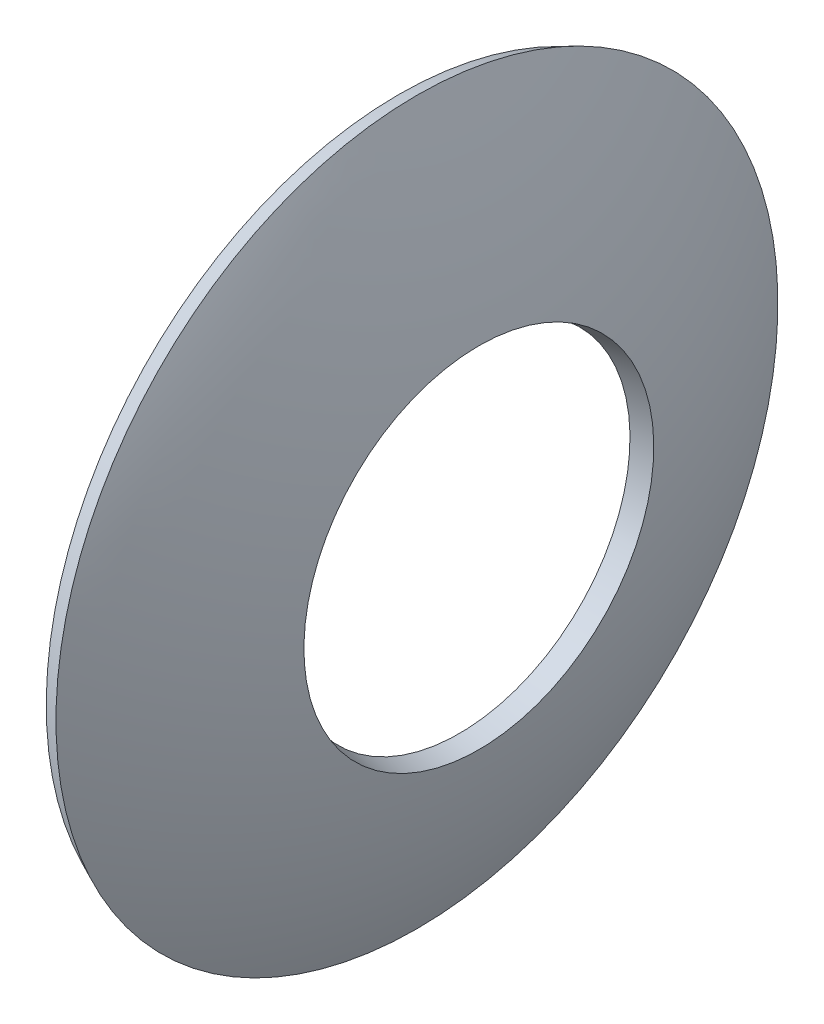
ISO-10303-21;
HEADER;
FILE_DESCRIPTION(('STEP AP214'),'2;1');
FILE_NAME('part.step','',(''),(''),'','','');
FILE_SCHEMA(('AUTOMOTIVE_DESIGN { 1 0 10303 214 1 1 1 1 }'));
ENDSEC;
DATA;
#1=APPLICATION_CONTEXT('core data for automotive mechanical design processes');
#2=APPLICATION_PROTOCOL_DEFINITION('international standard','automotive_design',2000,#1);
#3=PRODUCT_CONTEXT('',#1,'mechanical');
#4=PRODUCT('Part','Part','',(#3));
#5=PRODUCT_RELATED_PRODUCT_CATEGORY('part','',(#4));
#6=PRODUCT_DEFINITION_FORMATION('','',#4);
#7=PRODUCT_DEFINITION_CONTEXT('part definition',#1,'design');
#8=PRODUCT_DEFINITION('design','',#6,#7);
#9=PRODUCT_DEFINITION_SHAPE('','',#8);
#10=(LENGTH_UNIT() NAMED_UNIT(*) SI_UNIT(.MILLI.,.METRE.));
#11=(NAMED_UNIT(*) PLANE_ANGLE_UNIT() SI_UNIT($,.RADIAN.));
#12=(NAMED_UNIT(*) SI_UNIT($,.STERADIAN.) SOLID_ANGLE_UNIT());
#13=UNCERTAINTY_MEASURE_WITH_UNIT(LENGTH_MEASURE(1.E-05),#10,'distance_accuracy_value','');
#14=(GEOMETRIC_REPRESENTATION_CONTEXT(3) GLOBAL_UNCERTAINTY_ASSIGNED_CONTEXT((#13)) GLOBAL_UNIT_ASSIGNED_CONTEXT((#10,
#11,#12)) REPRESENTATION_CONTEXT('',''));
#15=CARTESIAN_POINT('',(0.,0.,0.));
#16=DIRECTION('',(0.,0.,1.));
#17=DIRECTION('',(1.,0.,0.));
#18=AXIS2_PLACEMENT_3D('',#15,#16,#17);
#19=CARTESIAN_POINT('',(0.,0.,0.));
#20=DIRECTION('',(-1.,0.,0.));
#21=DIRECTION('',(0.,1.,0.));
#22=AXIS2_PLACEMENT_3D('',#19,#20,#21);
#23=SPHERICAL_SURFACE('',#22,41.5);
#24=CARTESIAN_POINT('',(40.6201920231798,0.,0.));
#25=DIRECTION('',(-1.,0.,0.));
#26=DIRECTION('',(0.,0.,1.));
#27=AXIS2_PLACEMENT_3D('',#24,#25,#26);
#28=CIRCLE('',#27,8.5);
#29=CARTESIAN_POINT('',(40.6201920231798,8.50000000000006,0.));
#30=VERTEX_POINT('',#29);
#31=EDGE_CURVE('E58',#30,#30,#28,.T.);
#32=CARTESIAN_POINT('',(37.6117731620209,0.,0.));
#33=DIRECTION('',(-1.,0.,0.));
#34=DIRECTION('',(0.,0.,1.));
#35=AXIS2_PLACEMENT_3D('',#32,#33,#34);
#36=CIRCLE('',#35,17.5386578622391);
#37=CARTESIAN_POINT('',(37.6117731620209,17.5386578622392,0.));
#38=VERTEX_POINT('',#37);
#39=EDGE_CURVE('E12',#38,#38,#36,.T.);
#40=CARTESIAN_POINT('',(40.6201920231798,8.50000000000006,0.));
#41=CARTESIAN_POINT('',(40.5998227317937,8.59734174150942,0.));
#42=CARTESIAN_POINT('',(40.5791035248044,8.69461026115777,0.));
#43=CARTESIAN_POINT('',(40.5369663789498,8.88899583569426,0.));
#44=CARTESIAN_POINT('',(40.5155484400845,8.9861128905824,0.));
#45=CARTESIAN_POINT('',(40.4720149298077,9.1801905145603,0.));
#46=CARTESIAN_POINT('',(40.4498993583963,9.27715108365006,0.));
#47=CARTESIAN_POINT('',(40.4049717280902,9.47091072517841,0.));
#48=CARTESIAN_POINT('',(40.3821596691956,9.56770979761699,0.));
#49=CARTESIAN_POINT('',(40.3358402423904,9.76114144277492,0.));
#50=CARTESIAN_POINT('',(40.3123328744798,9.85777401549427,0.));
#51=CARTESIAN_POINT('',(40.264624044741,10.0508676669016,0.));
#52=CARTESIAN_POINT('',(40.2404225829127,10.1473287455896,0.));
#53=CARTESIAN_POINT('',(40.1913268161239,10.3400744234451,0.));
#54=CARTESIAN_POINT('',(40.1664325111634,10.4363590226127,0.));
#55=CARTESIAN_POINT('',(40.1159523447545,10.6287467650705,0.));
#56=CARTESIAN_POINT('',(40.090366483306,10.7248499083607,0.));
#57=CARTESIAN_POINT('',(40.0385045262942,10.916869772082,0.));
#58=CARTESIAN_POINT('',(40.0122284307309,11.0127864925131,0.));
#59=CARTESIAN_POINT('',(39.9589873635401,11.2044285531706,0.));
#60=CARTESIAN_POINT('',(39.9320223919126,11.3001538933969,0.));
#61=CARTESIAN_POINT('',(39.877404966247,11.49140824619,0.));
#62=CARTESIAN_POINT('',(39.8497525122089,11.5869372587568,0.));
#63=CARTESIAN_POINT('',(39.7937615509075,11.7777940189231,0.));
#64=CARTESIAN_POINT('',(39.7654230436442,11.8731217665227,0.));
#65=CARTESIAN_POINT('',(39.7080614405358,12.063571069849,0.));
#66=CARTESIAN_POINT('',(39.6790383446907,12.1586926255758,0.));
#67=CARTESIAN_POINT('',(39.6203090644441,12.3487246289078,0.));
#68=CARTESIAN_POINT('',(39.5906028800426,12.443635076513,0.));
#69=CARTESIAN_POINT('',(39.5305089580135,12.633239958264,0.));
#70=CARTESIAN_POINT('',(39.5001212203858,12.7279343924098,0.));
#71=CARTESIAN_POINT('',(39.4386657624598,12.9171023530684,0.));
#72=CARTESIAN_POINT('',(39.4075980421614,13.0115758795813,0.));
#73=CARTESIAN_POINT('',(39.3447842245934,13.200297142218,0.));
#74=CARTESIAN_POINT('',(39.3130381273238,13.2945448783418,0.));
#75=CARTESIAN_POINT('',(39.2488691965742,13.4828096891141,0.));
#76=CARTESIAN_POINT('',(39.2164463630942,13.5768267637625,0.));
#77=CARTESIAN_POINT('',(39.1509256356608,13.7646253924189,0.));
#78=CARTESIAN_POINT('',(39.1178277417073,13.8584069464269,0.));
#79=CARTESIAN_POINT('',(39.0509586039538,14.0457296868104,0.));
#80=CARTESIAN_POINT('',(39.0171873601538,14.1392708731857,0.));
#81=CARTESIAN_POINT('',(38.9489732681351,14.3261080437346,0.));
#82=CARTESIAN_POINT('',(38.9145304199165,14.4194040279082,0.));
#83=CARTESIAN_POINT('',(38.8449748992,14.6057459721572,0.));
#84=CARTESIAN_POINT('',(38.8098622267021,14.6987919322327,0.));
#85=CARTESIAN_POINT('',(38.7389688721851,14.8846290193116,0.));
#86=CARTESIAN_POINT('',(38.7031881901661,14.9774201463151,0.));
#87=CARTESIAN_POINT('',(38.6309606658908,15.1627427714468,0.));
#88=CARTESIAN_POINT('',(38.5945138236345,15.2552742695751,0.));
#89=CARTESIAN_POINT('',(38.5209558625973,15.4400728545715,0.));
#90=CARTESIAN_POINT('',(38.4838447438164,15.5323399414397,0.));
#91=CARTESIAN_POINT('',(38.4089601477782,15.7166049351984,0.));
#92=CARTESIAN_POINT('',(38.371186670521,15.8086028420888,0.));
#93=CARTESIAN_POINT('',(38.2949793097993,15.992324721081,0.));
#94=CARTESIAN_POINT('',(38.2565454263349,16.0840486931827,0.));
#95=CARTESIAN_POINT('',(38.1790192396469,16.2672179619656,0.));
#96=CARTESIAN_POINT('',(38.1399269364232,16.3586632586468,0.));
#97=CARTESIAN_POINT('',(38.0610859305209,16.5412704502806,0.));
#98=CARTESIAN_POINT('',(38.0213372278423,16.6324323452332,0.));
#99=CARTESIAN_POINT('',(37.9411854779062,16.814468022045,0.));
#100=CARTESIAN_POINT('',(37.9007824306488,16.905341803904,0.));
#101=CARTESIAN_POINT('',(37.8193240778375,17.0867965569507,0.));
#102=CARTESIAN_POINT('',(37.7782687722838,17.1773775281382,0.));
#103=CARTESIAN_POINT('',(37.6955080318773,17.358241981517,0.));
#104=CARTESIAN_POINT('',(37.6538025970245,17.4485254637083,0.));
#105=CARTESIAN_POINT('',(37.6117731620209,17.5386578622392,0.));
#106=B_SPLINE_CURVE_WITH_KNOTS('',3,(#40,#41,#42,#43,#44,#45,#46,#47,#48,#49,#50,#51,#52,#53,
#54,#55,#56,#57,#58,#59,#60,#61,#62,#63,#64,#65,#66,#67,#68,#69,#70,#71,#72,#73,#74,#75,#76,#77,
#78,#79,#80,#81,#82,#83,#84,#85,#86,#87,#88,#89,#90,#91,#92,#93,#94,#95,#96,#97,#98,#99,#100,
#101,#102,#103,#104,#105),.UNSPECIFIED.,.F.,.F.,(4,2,2,2,2,2,2,2,2,2,2,2,2,2,2,2,2,2,2,2,2,2,2,
2,2,2,2,2,2,2,2,2,4),(0.,0.298349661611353,0.596699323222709,0.895048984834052,1.19339864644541,
1.49174830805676,1.79009796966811,2.08844763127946,2.38679729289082,2.68514695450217,
2.98349661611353,3.28184627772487,3.58019593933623,3.87854560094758,4.17689526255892,
4.47524492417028,4.77359458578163,5.07194424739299,5.37029390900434,5.66864357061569,
5.96699323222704,6.2653428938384,6.56369255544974,6.8620422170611,7.16039187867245,
7.4587415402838,7.75709120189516,8.0554408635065,8.35379052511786,8.65214018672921,
8.95048984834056,9.24883950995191,9.54718917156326),.UNSPECIFIED.);
#107=EDGE_CURVE('BSEAM44',#30,#38,#106,.T.);
#108=ORIENTED_EDGE('',*,*,#31,.F.);
#109=ORIENTED_EDGE('',*,*,#39,.T.);
#110=ORIENTED_EDGE('',*,*,#107,.T.);
#111=ORIENTED_EDGE('',*,*,#107,.F.);
#112=EDGE_LOOP('',(#108,#110,#109,#111));
#113=FACE_BOUND('',#112,.T.);
#114=ADVANCED_FACE('F44',(#113),#23,.F.);
#115=CARTESIAN_POINT('',(37.6117731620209,0.,0.));
#116=DIRECTION('',(1.,0.,0.));
#117=DIRECTION('',(0.,0.,-1.));
#118=AXIS2_PLACEMENT_3D('',#115,#116,#117);
#119=CONICAL_SURFACE('',#118,17.5386578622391,0.436332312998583);
#120=CARTESIAN_POINT('',(38.5180809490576,0.,0.));
#121=DIRECTION('',(-1.,0.,0.));
#122=DIRECTION('',(0.,0.,1.));
#123=AXIS2_PLACEMENT_3D('',#120,#121,#122);
#124=CIRCLE('',#123,17.9612761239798);
#125=CARTESIAN_POINT('',(38.5180809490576,17.9612761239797,0.));
#126=VERTEX_POINT('',#125);
#127=EDGE_CURVE('E50',#126,#126,#124,.T.);
#128=ORIENTED_EDGE('',*,*,#127,.T.);
#129=EDGE_LOOP('',(#128));
#130=FACE_BOUND('',#129,.T.);
#131=ORIENTED_EDGE('',*,*,#39,.F.);
#132=EDGE_LOOP('',(#131));
#133=FACE_BOUND('',#132,.T.);
#134=ADVANCED_FACE('F68',(#130,#133),#119,.T.);
#135=CARTESIAN_POINT('',(0.,0.,0.));
#136=DIRECTION('',(-1.,0.,0.));
#137=DIRECTION('',(0.,1.,0.));
#138=AXIS2_PLACEMENT_3D('',#135,#136,#137);
#139=SPHERICAL_SURFACE('',#138,42.5);
#140=CARTESIAN_POINT('',(41.5989918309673,0.,0.));
#141=DIRECTION('',(-1.,0.,0.));
#142=DIRECTION('',(0.,0.,1.));
#143=AXIS2_PLACEMENT_3D('',#140,#141,#142);
#144=CIRCLE('',#143,8.70481927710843);
#145=CARTESIAN_POINT('',(41.5989918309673,8.70481927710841,0.));
#146=VERTEX_POINT('',#145);
#147=EDGE_CURVE('E54',#146,#146,#144,.T.);
#148=CARTESIAN_POINT('',(41.5989918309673,8.70481927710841,0.));
#149=CARTESIAN_POINT('',(41.5781317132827,8.80450660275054,0.));
#150=CARTESIAN_POINT('',(41.5569132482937,8.90411894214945,0.));
#151=CARTESIAN_POINT('',(41.513760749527,9.1031885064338,0.));
#152=CARTESIAN_POINT('',(41.4918267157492,9.20264573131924,0.));
#153=CARTESIAN_POINT('',(41.4472442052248,9.40139992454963,0.));
#154=CARTESIAN_POINT('',(41.4245957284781,9.50069689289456,0.));
#155=CARTESIAN_POINT('',(41.3785855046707,9.69912544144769,0.));
#156=CARTESIAN_POINT('',(41.35522375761,9.79825702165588,0.));
#157=CARTESIAN_POINT('',(41.3077882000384,9.99634967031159,0.));
#158=CARTESIAN_POINT('',(41.2837143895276,10.0953107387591,0.));
#159=CARTESIAN_POINT('',(41.2348559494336,10.2930572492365,0.));
#160=CARTESIAN_POINT('',(41.2100713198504,10.3918426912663,0.));
#161=CARTESIAN_POINT('',(41.1597925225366,10.5892328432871,0.));
#162=CARTESIAN_POINT('',(41.1342983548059,10.687837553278,0.));
#163=CARTESIAN_POINT('',(41.082601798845,10.8848611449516,0.));
#164=CARTESIAN_POINT('',(41.0563994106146,10.9832800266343,0.));
#165=CARTESIAN_POINT('',(41.0032877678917,11.1799268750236,0.));
#166=CARTESIAN_POINT('',(40.9763785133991,11.2781548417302,0.));
#167=CARTESIAN_POINT('',(40.9218545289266,11.4744147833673,0.));
#168=CARTESIAN_POINT('',(40.8942397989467,11.5724467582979,0.));
#169=CARTESIAN_POINT('',(40.8383062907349,11.7683096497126,0.));
#170=CARTESIAN_POINT('',(40.8099875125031,11.8661405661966,0.));
#171=CARTESIAN_POINT('',(40.7526473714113,12.0615962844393,0.));
#172=CARTESIAN_POINT('',(40.7236260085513,12.1592210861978,0.));
#173=CARTESIAN_POINT('',(40.6648821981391,12.3542595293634,0.));
#174=CARTESIAN_POINT('',(40.6351597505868,12.4516731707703,0.));
#175=CARTESIAN_POINT('',(40.5750153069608,12.6462842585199,0.));
#176=CARTESIAN_POINT('',(40.544593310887,12.7434817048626,0.));
#177=CARTESIAN_POINT('',(40.483051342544,12.937655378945,0.));
#178=CARTESIAN_POINT('',(40.4519313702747,13.0346316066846,0.));
#179=CARTESIAN_POINT('',(40.3889950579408,13.2283578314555,0.));
#180=CARTESIAN_POINT('',(40.3571787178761,13.3251078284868,0.));
#181=CARTESIAN_POINT('',(40.2928513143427,13.5183765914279,0.));
#182=CARTESIAN_POINT('',(40.2603402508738,13.6148953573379,0.));
#183=CARTESIAN_POINT('',(40.1946250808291,13.8076966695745,0.));
#184=CARTESIAN_POINT('',(40.1614209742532,13.9039792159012,0.));
#185=CARTESIAN_POINT('',(40.0943214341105,14.096303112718,0.));
#186=CARTESIAN_POINT('',(40.0604260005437,14.1923444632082,0.));
#187=CARTESIAN_POINT('',(39.991945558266,14.3841810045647,0.));
#188=CARTESIAN_POINT('',(39.9573605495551,14.4799761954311,0.));
#189=CARTESIAN_POINT('',(39.8875027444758,14.6713154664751,0.));
#190=CARTESIAN_POINT('',(39.8522299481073,14.7668595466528,0.));
#191=CARTESIAN_POINT('',(39.780998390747,14.9576916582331,0.));
#192=CARTESIAN_POINT('',(39.7450396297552,15.0529796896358,0.));
#193=CARTESIAN_POINT('',(39.6724380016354,15.243294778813,0.));
#194=CARTESIAN_POINT('',(39.6357951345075,15.3383218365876,0.));
#195=CARTESIAN_POINT('',(39.5618271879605,15.5281100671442,0.));
#196=CARTESIAN_POINT('',(39.5245021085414,15.6228712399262,0.));
#197=CARTESIAN_POINT('',(39.4491716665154,15.8121228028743,0.));
#198=CARTESIAN_POINT('',(39.4111663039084,15.9066131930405,0.));
#199=CARTESIAN_POINT('',(39.3344772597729,16.0953183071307,0.));
#200=CARTESIAN_POINT('',(39.2957935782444,16.1895330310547,0.));
#201=CARTESIAN_POINT('',(39.2177498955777,16.3776819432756,0.));
#202=CARTESIAN_POINT('',(39.1783898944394,16.4716161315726,0.));
#203=CARTESIAN_POINT('',(39.0989956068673,16.6591991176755,0.));
#204=CARTESIAN_POINT('',(39.0589613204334,16.7528479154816,0.));
#205=CARTESIAN_POINT('',(38.9782205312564,16.9398552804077,0.));
#206=CARTESIAN_POINT('',(38.9375140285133,17.0332138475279,0.));
#207=CARTESIAN_POINT('',(38.8554309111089,17.2196359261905,0.));
#208=CARTESIAN_POINT('',(38.8140542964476,17.3126994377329,0.));
#209=CARTESIAN_POINT('',(38.7306330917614,17.4985265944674,0.));
#210=CARTESIAN_POINT('',(38.6885885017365,17.5912902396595,0.));
#211=CARTESIAN_POINT('',(38.6038335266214,17.7765128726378,0.));
#212=CARTESIAN_POINT('',(38.5611231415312,17.868971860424,0.));
#213=CARTESIAN_POINT('',(38.5180809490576,17.9612761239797,0.));
#214=B_SPLINE_CURVE_WITH_KNOTS('',3,(#148,#149,#150,#151,#152,#153,#154,#155,#156,#157,#158,
#159,#160,#161,#162,#163,#164,#165,#166,#167,#168,#169,#170,#171,#172,#173,#174,#175,#176,#177,
#178,#179,#180,#181,#182,#183,#184,#185,#186,#187,#188,#189,#190,#191,#192,#193,#194,#195,#196,
#197,#198,#199,#200,#201,#202,#203,#204,#205,#206,#207,#208,#209,#210,#211,#212,#213),
.UNSPECIFIED.,.F.,.F.,(4,2,2,2,2,2,2,2,2,2,2,2,2,2,2,2,2,2,2,2,2,2,2,2,2,2,2,2,2,2,2,2,4),(0.,
0.305538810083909,0.611077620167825,0.916616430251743,1.22215524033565,1.52769405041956,
1.83323286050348,2.13877167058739,2.4443104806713,2.74984929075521,3.05538810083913,
3.36092691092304,3.66646572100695,3.97200453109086,4.27754334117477,4.58308215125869,
4.8886209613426,5.19415977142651,5.49969858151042,5.80523739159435,6.11077620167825,
6.41631501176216,6.72185382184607,7.02739263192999,7.3329314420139,7.63847025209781,
7.94400906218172,8.24954787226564,8.55508668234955,8.86062549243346,9.16616430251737,
9.47170311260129,9.7772419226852),.UNSPECIFIED.);
#215=EDGE_CURVE('BSEAM72',#146,#126,#214,.T.);
#216=ORIENTED_EDGE('',*,*,#147,.T.);
#217=ORIENTED_EDGE('',*,*,#127,.F.);
#218=ORIENTED_EDGE('',*,*,#215,.T.);
#219=ORIENTED_EDGE('',*,*,#215,.F.);
#220=EDGE_LOOP('',(#216,#218,#217,#219));
#221=FACE_BOUND('',#220,.T.);
#222=ADVANCED_FACE('F72',(#221),#139,.T.);
#223=CARTESIAN_POINT('',(41.5989918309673,0.,0.));
#224=DIRECTION('',(1.,0.,0.));
#225=DIRECTION('',(0.,0.,-1.));
#226=AXIS2_PLACEMENT_3D('',#223,#224,#225);
#227=CONICAL_SURFACE('',#226,8.70481927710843,0.206279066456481);
#228=ORIENTED_EDGE('',*,*,#31,.T.);
#229=EDGE_LOOP('',(#228));
#230=FACE_BOUND('',#229,.T.);
#231=ORIENTED_EDGE('',*,*,#147,.F.);
#232=EDGE_LOOP('',(#231));
#233=FACE_BOUND('',#232,.T.);
#234=ADVANCED_FACE('F64',(#230,#233),#227,.F.);
#235=CLOSED_SHELL('',(#114,#134,#222,#234));
#236=MANIFOLD_SOLID_BREP('B2',#235);
#237=ADVANCED_BREP_SHAPE_REPRESENTATION('',(#18,#236),#14);
#238=SHAPE_DEFINITION_REPRESENTATION(#9,#237);
ENDSEC;
END-ISO-10303-21;
